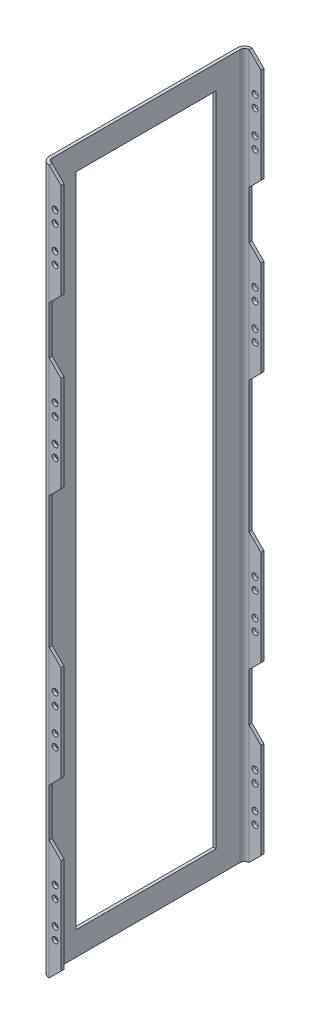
from build123d import *

# Parameters (mm, degrees)
MAINPLATEEXTRUDE_DEPTH = 374.65
FLANGECUT_DEPTH        = 107.95
SKETCH3_W              = 74.5998
SKETCH3_H              = 349.25
CUT_EXTRUDE2_DEPTH     = 1.5875
SKETCH4_R              = 1.5875
CUT_EXTRUDE3_DEPTH     = 127


with BuildPart() as part:
    # Sketch1 → MainPlateExtrude (new body)
    with BuildSketch(Plane(origin=(0, 0, 0), x_dir=(1, 0, 0), z_dir=(0, 1, 0))):
        with BuildLine():
            Line((-47.61865, -52.38115), (-41.26865, -52.38115))
            Line((-41.26865, -52.38115), (-41.26865, -53.96865))
            Line((-41.26865, -53.96865), (-47.61865, -53.96865))
            ThreePointArc((-47.61865, -53.96865), (-50.424980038, -52.806230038), (-51.5874, -49.9999))
            Line((-51.5874, -49.9999), (-51.5874, 49.9999))
            ThreePointArc((-51.5874, 49.9999), (-50.424980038, 52.806230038), (-47.61865, 53.96865))
            Line((-47.61865, 53.96865), (-41.26865, 53.96865))
            Line((-41.26865, 53.96865), (-41.26865, 52.38115))
            Line((-41.26865, 52.38115), (-47.61865, 52.38115))
            ThreePointArc((-47.61865, 52.38115), (-49.302448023, 51.683698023), (-49.9999, 49.9999))
            Line((-49.9999, 49.9999), (-49.9999, -49.9999))
            ThreePointArc((-49.9999, -49.9999), (-49.302448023, -51.683698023), (-47.61865, -52.38115))
        make_face()
    extrude(amount=MAINPLATEEXTRUDE_DEPTH)

    # Sketch2 → FlangeCut (cut)
    with BuildSketch(Plane.XY.offset(53.96865)):
        Polygon((-41.26865, 95.25), (-47.61865, 88.9), (-47.61865, 63.5), (-41.26865, 57.15), align=None)
        Polygon((-41.26865, 6.35), (-47.61865, 0), (-41.26865, 0), align=None)
        Polygon((-41.26865, 228.6), (-47.61865, 222.25), (-47.61865, 152.4), (-41.26865, 146.05), align=None)
        Polygon((-41.26865, 317.5), (-47.61865, 311.15), (-47.61865, 285.75), (-41.26865, 279.4), align=None)
        Polygon((-41.26865, 374.65), (-47.61865, 374.65), (-41.26865, 368.3), align=None)
    extrude(amount=-FLANGECUT_DEPTH, mode=Mode.SUBTRACT)

    # Sketch3 → Cut-Extrude2 (cut)
    with BuildSketch(Plane.ZY.offset(51.5874)):
        with Locations((0, 187.325)):
            Rectangle(SKETCH3_W, SKETCH3_H)
    extrude(amount=-CUT_EXTRUDE2_DEPTH, mode=Mode.SUBTRACT)

    # Sketch4 → Cut-Extrude3 (cut)
    with BuildSketch(Plane(origin=(0, 0, -53.96865), x_dir=(-1, 0, 0), z_dir=(0, 0, -1))):
        with Locations((44.44365, 38.1)):
            Circle(SKETCH4_R)
        with Locations((44.44365, 25.4)):
            Circle(SKETCH4_R)
        with Locations((44.44365, 44.45)):
            Circle(SKETCH4_R)
        with Locations((44.44365, 19.05)):
            Circle(SKETCH4_R)
        with Locations((44.44365, 114.3)):
            Circle(SKETCH4_R)
        with Locations((44.44365, 127)):
            Circle(SKETCH4_R)
        with Locations((44.44365, 133.35)):
            Circle(SKETCH4_R)
        with Locations((44.44365, 107.95)):
            Circle(SKETCH4_R)
        with Locations((44.44365, 336.55)):
            Circle(SKETCH4_R)
        with Locations((44.44365, 260.35)):
            Circle(SKETCH4_R)
        with Locations((44.44365, 349.25)):
            Circle(SKETCH4_R)
        with Locations((44.44365, 241.3)):
            Circle(SKETCH4_R)
        with Locations((44.44365, 355.6)):
            Circle(SKETCH4_R)
        with Locations((44.44365, 266.7)):
            Circle(SKETCH4_R)
        with Locations((44.44365, 330.2)):
            Circle(SKETCH4_R)
        with Locations((44.44365, 247.65)):
            Circle(SKETCH4_R)
    extrude(amount=-CUT_EXTRUDE3_DEPTH, mode=Mode.SUBTRACT)


solid = part.part
